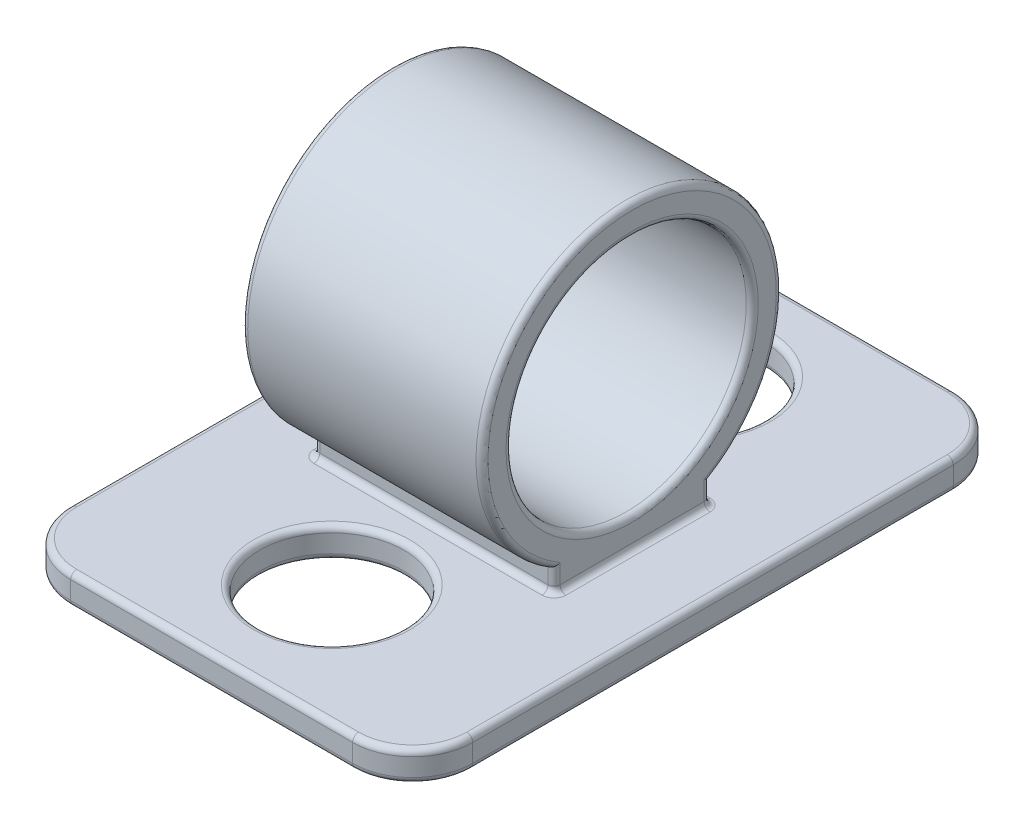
from build123d import *
from OCP.BRepFilletAPI import BRepFilletAPI_MakeFillet

# Parameters (mm, degrees)
SKETCH1_W           = 17
SKETCH1_H           = 25.4
SKETCH1_R           = 3.048
BOSS_EXTRUDE1_DEPTH = 1.27
FILLET1_R1          = 0.254
FILLET1_R2          = 2.54
SKETCH2_R           = 5.08
BOSS_EXTRUDE2_DEPTH = 5.08
FILLET3_R           = 0.254


with BuildPart() as part:
    # Sketch1 → Boss-Extrude1 (new body)
    with BuildSketch(Plane(origin=(0, 0, 0), x_dir=(1, 0, 0), z_dir=(0, 1, 0))):
        Rectangle(SKETCH1_W, SKETCH1_H)
        with Locations(Location((0, -7.62, 0), (0, 0, 270))):
            Circle(SKETCH1_R, mode=Mode.SUBTRACT)
        with Locations(Location((0, 7.62, 0), (0, 0, 90))):
            Circle(SKETCH1_R, mode=Mode.SUBTRACT)
    extrude(amount=BOSS_EXTRUDE1_DEPTH)

    # Fillet1: one fillet with a radius per group of edges: ONE call of the kernel's fillet builder (fillet() takes one radius for all edges)
    fillet1_edges_1 = [part.edges().sort_by_distance(p)[0] for p in [
        (-8.5, 1.27, 0),
        (0, 0, 4.572),
        (0, 1.27, 4.572),
        (0, 1.27, 12.7),
        (0, 0, -4.572),
        (0, 1.27, -4.572),
        (8.5, 1.27, 0),
        (0, 0, 12.7),
        (-8.5, 0, 0),
        (0, 0, -12.7),
        (8.5, 0, 0),
        (0, 1.27, -12.7),
    ]]
    fillet1_edges_2 = [part.edges().sort_by_distance(p)[0] for p in [
        (8.5, 0.635, 12.7),
        (-8.5, 0.635, 12.7),
        (-8.5, 0.635, -12.7),
        (8.5, 0.635, -12.7),
    ]]
    fillet1 = BRepFilletAPI_MakeFillet(part.part.solid().wrapped)
    for e in fillet1_edges_1:
        fillet1.Add(FILLET1_R1, e.wrapped)
    for e in fillet1_edges_2:
        fillet1.Add(FILLET1_R2, e.wrapped)
    add(Compound.cast(fillet1.Shape()), mode=Mode.REPLACE)

    # Sketch2 → Boss-Extrude2 (add, symmetric)
    with BuildSketch(Plane(origin=(0, 0, 0), x_dir=(0, 0, -1), z_dir=(1, 0, 0))):
        with BuildLine():
            Line((-3.302, 2.196044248), (-3.302, 1.140340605))
            Line((-3.302, 1.140340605), (3.302, 1.140340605))
            Line((3.302, 1.140340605), (3.302, 2.196044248))
            ThreePointArc((3.302, 2.196044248), (0, 13.97), (-3.302, 2.196044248))
        make_face()
        with Locations((0, 7.62)):
            Circle(SKETCH2_R, mode=Mode.SUBTRACT)
    extrude(amount=BOSS_EXTRUDE2_DEPTH, both=True)

    # Fillet3
    fillet3_edges = [part.edges().sort_by_distance(p)[0] for p in [
        (0, 1.27, -3.302),
        (-5.08, 1.27, 0),
        (5.08, 1.27, 0),
        (0, 1.27, 3.302),
        (5.08, 1.733022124, 3.302),
        (5.08, 1.733022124, -3.302),
        (5.08, 13.97, 0),
        (-5.08, 7.62, 5.08),
        (-5.08, 13.97, 0),
        (-5.08, 1.733022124, 3.302),
        (-5.08, 1.733022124, -3.302),
        (5.08, 7.62, 5.08),
    ]]
    fillet(fillet3_edges, radius=FILLET3_R)


solid = part.part
